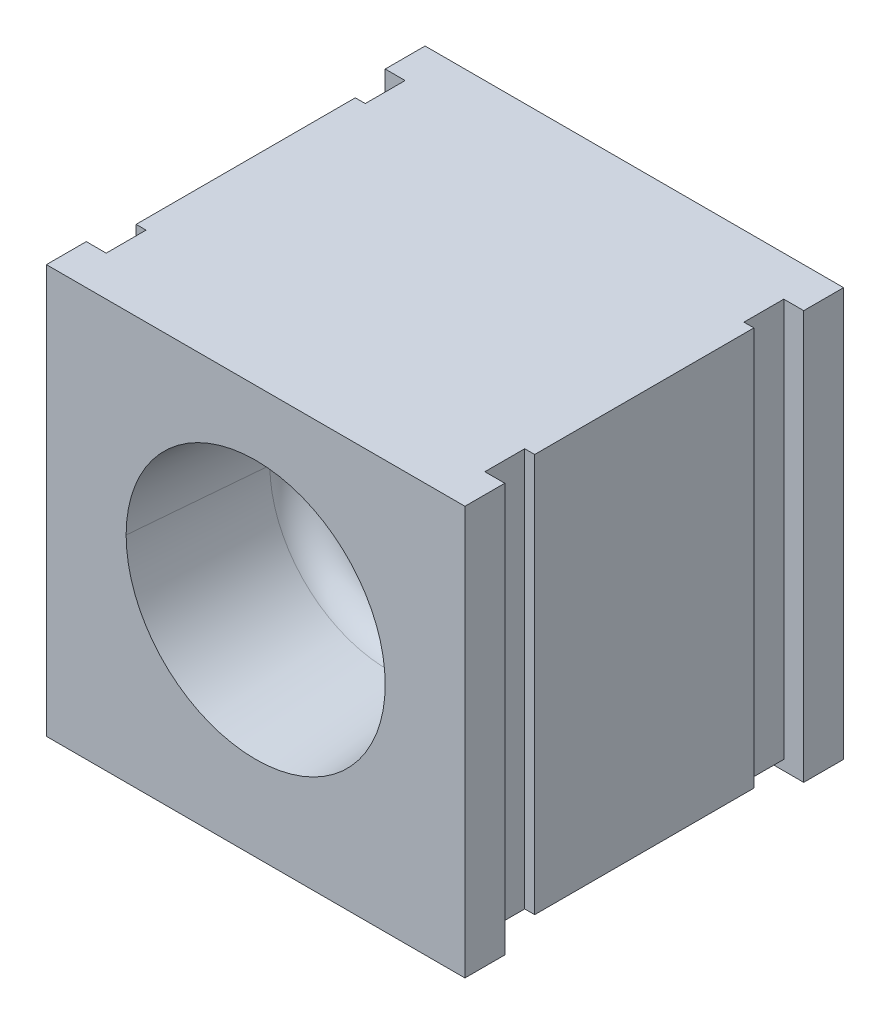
ISO-10303-21;
HEADER;
FILE_DESCRIPTION(('STEP AP214'),'2;1');
FILE_NAME('part.step','',(''),(''),'','','');
FILE_SCHEMA(('AUTOMOTIVE_DESIGN { 1 0 10303 214 1 1 1 1 }'));
ENDSEC;
DATA;
#1=APPLICATION_CONTEXT('core data for automotive mechanical design processes');
#2=APPLICATION_PROTOCOL_DEFINITION('international standard','automotive_design',2000,#1);
#3=PRODUCT_CONTEXT('',#1,'mechanical');
#4=PRODUCT('Part','Part','',(#3));
#5=PRODUCT_RELATED_PRODUCT_CATEGORY('part','',(#4));
#6=PRODUCT_DEFINITION_FORMATION('','',#4);
#7=PRODUCT_DEFINITION_CONTEXT('part definition',#1,'design');
#8=PRODUCT_DEFINITION('design','',#6,#7);
#9=PRODUCT_DEFINITION_SHAPE('','',#8);
#10=(LENGTH_UNIT() NAMED_UNIT(*) SI_UNIT(.MILLI.,.METRE.));
#11=(NAMED_UNIT(*) PLANE_ANGLE_UNIT() SI_UNIT($,.RADIAN.));
#12=(NAMED_UNIT(*) SI_UNIT($,.STERADIAN.) SOLID_ANGLE_UNIT());
#13=UNCERTAINTY_MEASURE_WITH_UNIT(LENGTH_MEASURE(1.E-05),#10,'distance_accuracy_value','');
#14=(GEOMETRIC_REPRESENTATION_CONTEXT(3) GLOBAL_UNCERTAINTY_ASSIGNED_CONTEXT((#13)) GLOBAL_UNIT_ASSIGNED_CONTEXT((#10,
#11,#12)) REPRESENTATION_CONTEXT('',''));
#15=CARTESIAN_POINT('',(0.,0.,0.));
#16=DIRECTION('',(0.,0.,1.));
#17=DIRECTION('',(1.,0.,0.));
#18=AXIS2_PLACEMENT_3D('',#15,#16,#17);
#19=CARTESIAN_POINT('',(10.5,-10.,40.0059515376));
#20=DIRECTION('',(0.,1.,0.));
#21=DIRECTION('',(1.,0.,0.));
#22=AXIS2_PLACEMENT_3D('',#19,#20,#21);
#23=PLANE('',#22);
#24=DIRECTION('',(0.,0.,-1.));
#25=VECTOR('',#24,1.);
#26=CARTESIAN_POINT('',(-10.5,-10.,40.0059515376));
#27=LINE('',#26,#25);
#28=CARTESIAN_POINT('',(-10.5,-10.,2.));
#29=VERTEX_POINT('',#28);
#30=CARTESIAN_POINT('',(-10.5,-10.,0.));
#31=VERTEX_POINT('',#30);
#32=EDGE_CURVE('E291',#29,#31,#27,.T.);
#33=ORIENTED_EDGE('',*,*,#32,.T.);
#34=DIRECTION('',(1.,0.,0.));
#35=VECTOR('',#34,1.);
#36=CARTESIAN_POINT('',(10.5,-10.,0.));
#37=LINE('',#36,#35);
#38=CARTESIAN_POINT('',(10.5,-10.,0.));
#39=VERTEX_POINT('',#38);
#40=EDGE_CURVE('E372',#31,#39,#37,.T.);
#41=ORIENTED_EDGE('',*,*,#40,.T.);
#42=DIRECTION('',(0.,0.,-1.));
#43=VECTOR('',#42,1.);
#44=CARTESIAN_POINT('',(10.5,-10.,40.0059515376));
#45=LINE('',#44,#43);
#46=CARTESIAN_POINT('',(10.5,-10.,2.));
#47=VERTEX_POINT('',#46);
#48=EDGE_CURVE('E299',#47,#39,#45,.T.);
#49=ORIENTED_EDGE('',*,*,#48,.F.);
#50=DIRECTION('',(1.,0.,0.));
#51=VECTOR('',#50,1.);
#52=CARTESIAN_POINT('',(-10.5,-10.,2.));
#53=LINE('',#52,#51);
#54=EDGE_CURVE('E253',#29,#47,#53,.T.);
#55=ORIENTED_EDGE('',*,*,#54,.F.);
#56=EDGE_LOOP('',(#33,#41,#49,#55));
#57=FACE_BOUND('',#56,.T.);
#58=ADVANCED_FACE('F15',(#57),#23,.F.);
#59=CARTESIAN_POINT('',(10.5,-10.,40.0059515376));
#60=DIRECTION('',(0.,1.,0.));
#61=DIRECTION('',(1.,0.,0.));
#62=AXIS2_PLACEMENT_3D('',#59,#60,#61);
#63=PLANE('',#62);
#64=DIRECTION('',(0.,0.,-1.));
#65=VECTOR('',#64,1.);
#66=CARTESIAN_POINT('',(10.5,-10.,40.0059515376));
#67=LINE('',#66,#65);
#68=CARTESIAN_POINT('',(10.5,-10.,19.));
#69=VERTEX_POINT('',#68);
#70=CARTESIAN_POINT('',(10.5,-10.,17.));
#71=VERTEX_POINT('',#70);
#72=EDGE_CURVE('E178',#69,#71,#67,.T.);
#73=ORIENTED_EDGE('',*,*,#72,.F.);
#74=DIRECTION('',(1.,0.,0.));
#75=VECTOR('',#74,1.);
#76=CARTESIAN_POINT('',(10.5,-10.,19.));
#77=LINE('',#76,#75);
#78=CARTESIAN_POINT('',(-10.5,-10.,19.));
#79=VERTEX_POINT('',#78);
#80=EDGE_CURVE('E37',#79,#69,#77,.T.);
#81=ORIENTED_EDGE('',*,*,#80,.F.);
#82=DIRECTION('',(0.,0.,-1.));
#83=VECTOR('',#82,1.);
#84=CARTESIAN_POINT('',(-10.5,-10.,40.0059515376));
#85=LINE('',#84,#83);
#86=CARTESIAN_POINT('',(-10.5,-10.,17.));
#87=VERTEX_POINT('',#86);
#88=EDGE_CURVE('E184',#79,#87,#85,.T.);
#89=ORIENTED_EDGE('',*,*,#88,.T.);
#90=DIRECTION('',(-1.,0.,0.));
#91=VECTOR('',#90,1.);
#92=CARTESIAN_POINT('',(-10.5,-10.,17.));
#93=LINE('',#92,#91);
#94=EDGE_CURVE('E188',#71,#87,#93,.T.);
#95=ORIENTED_EDGE('',*,*,#94,.F.);
#96=EDGE_LOOP('',(#73,#81,#89,#95));
#97=FACE_BOUND('',#96,.T.);
#98=ADVANCED_FACE('F186',(#97),#63,.F.);
#99=CARTESIAN_POINT('',(0.,0.75,12.5));
#100=DIRECTION('',(0.,0.,1.));
#101=DIRECTION('',(1.,0.,0.));
#102=AXIS2_PLACEMENT_3D('',#99,#100,#101);
#103=TOROIDAL_SURFACE('',#102,4.42559393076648,1.5);
#104=CARTESIAN_POINT('',(-4.42559393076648,0.75,12.5));
#105=DIRECTION('',(0.,1.,0.));
#106=DIRECTION('',(-1.,0.,0.));
#107=AXIS2_PLACEMENT_3D('',#104,#105,#106);
#108=CIRCLE('',#107,1.5);
#109=CARTESIAN_POINT('',(-4.42559393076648,0.75,11.));
#110=VERTEX_POINT('',#109);
#111=CARTESIAN_POINT('',(-5.91988597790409,0.75,12.3692663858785));
#112=VERTEX_POINT('',#111);
#113=EDGE_CURVE('E613',#110,#112,#108,.T.);
#114=ORIENTED_EDGE('',*,*,#113,.F.);
#115=CARTESIAN_POINT('',(0.,0.75,11.));
#116=DIRECTION('',(0.,0.,1.));
#117=DIRECTION('',(1.,0.,0.));
#118=AXIS2_PLACEMENT_3D('',#115,#116,#117);
#119=CIRCLE('',#118,4.42559393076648);
#120=CARTESIAN_POINT('',(4.42559393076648,0.75,11.));
#121=VERTEX_POINT('',#120);
#122=EDGE_CURVE('E9',#121,#110,#119,.T.);
#123=ORIENTED_EDGE('',*,*,#122,.F.);
#124=CARTESIAN_POINT('',(4.42559393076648,0.75,12.5));
#125=DIRECTION('',(0.,-1.,0.));
#126=DIRECTION('',(0.,0.,-1.));
#127=AXIS2_PLACEMENT_3D('',#124,#125,#126);
#128=CIRCLE('',#127,1.5);
#129=CARTESIAN_POINT('',(5.91988597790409,0.75,12.3692663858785));
#130=VERTEX_POINT('',#129);
#131=EDGE_CURVE('E532',#121,#130,#128,.T.);
#132=ORIENTED_EDGE('',*,*,#131,.T.);
#133=CARTESIAN_POINT('',(0.,0.75,12.3692663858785));
#134=DIRECTION('',(0.,0.,-1.));
#135=DIRECTION('',(-1.,0.,0.));
#136=AXIS2_PLACEMENT_3D('',#133,#134,#135);
#137=CIRCLE('',#136,5.91988597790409);
#138=EDGE_CURVE('E24',#112,#130,#137,.T.);
#139=ORIENTED_EDGE('',*,*,#138,.F.);
#140=EDGE_LOOP('',(#114,#123,#132,#139));
#141=FACE_BOUND('',#140,.T.);
#142=ADVANCED_FACE('F473',(#141),#103,.F.);
#143=CARTESIAN_POINT('',(0.,0.75,11.));
#144=DIRECTION('',(0.,0.,1.));
#145=DIRECTION('',(1.,0.,0.));
#146=AXIS2_PLACEMENT_3D('',#143,#144,#145);
#147=PLANE('',#146);
#148=ORIENTED_EDGE('',*,*,#122,.T.);
#149=CARTESIAN_POINT('',(0.,0.75,11.));
#150=DIRECTION('',(0.,0.,1.));
#151=DIRECTION('',(1.,0.,0.));
#152=AXIS2_PLACEMENT_3D('',#149,#150,#151);
#153=CIRCLE('',#152,4.42559393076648);
#154=EDGE_CURVE('E623',#110,#121,#153,.T.);
#155=ORIENTED_EDGE('',*,*,#154,.T.);
#156=EDGE_LOOP('',(#148,#155));
#157=FACE_BOUND('',#156,.T.);
#158=ADVANCED_FACE('F601',(#157),#147,.T.);
#159=CARTESIAN_POINT('',(0.,0.75,19.));
#160=DIRECTION('',(0.,0.,1.));
#161=DIRECTION('',(1.,0.,0.));
#162=AXIS2_PLACEMENT_3D('',#159,#160,#161);
#163=CONICAL_SURFACE('',#162,6.5,0.0872664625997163);
#164=DIRECTION('',(-0.0871557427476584,0.,0.996194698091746));
#165=VECTOR('',#164,1.);
#166=CARTESIAN_POINT('',(-6.5,0.75,19.));
#167=LINE('',#166,#165);
#168=CARTESIAN_POINT('',(-6.5,0.75,19.));
#169=VERTEX_POINT('',#168);
#170=EDGE_CURVE('E529',#112,#169,#167,.T.);
#171=ORIENTED_EDGE('',*,*,#170,.F.);
#172=ORIENTED_EDGE('',*,*,#138,.T.);
#173=DIRECTION('',(0.0871557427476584,0.,0.996194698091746));
#174=VECTOR('',#173,1.);
#175=CARTESIAN_POINT('',(6.5,0.75,19.));
#176=LINE('',#175,#174);
#177=CARTESIAN_POINT('',(6.5,0.75,19.));
#178=VERTEX_POINT('',#177);
#179=EDGE_CURVE('E441',#130,#178,#176,.T.);
#180=ORIENTED_EDGE('',*,*,#179,.T.);
#181=CARTESIAN_POINT('',(0.,0.75,19.));
#182=DIRECTION('',(0.,0.,1.));
#183=DIRECTION('',(1.,0.,0.));
#184=AXIS2_PLACEMENT_3D('',#181,#182,#183);
#185=CIRCLE('',#184,6.5);
#186=EDGE_CURVE('E221',#178,#169,#185,.T.);
#187=ORIENTED_EDGE('',*,*,#186,.T.);
#188=EDGE_LOOP('',(#171,#172,#180,#187));
#189=FACE_BOUND('',#188,.T.);
#190=ADVANCED_FACE('F594',(#189),#163,.F.);
#191=CARTESIAN_POINT('',(-10.5,-10.5,19.));
#192=DIRECTION('',(0.,0.,1.));
#193=DIRECTION('',(1.,0.,0.));
#194=AXIS2_PLACEMENT_3D('',#191,#192,#193);
#195=PLANE('',#194);
#196=ORIENTED_EDGE('',*,*,#186,.F.);
#197=CARTESIAN_POINT('',(0.,0.75,19.));
#198=DIRECTION('',(0.,0.,1.));
#199=DIRECTION('',(1.,0.,0.));
#200=AXIS2_PLACEMENT_3D('',#197,#198,#199);
#201=CIRCLE('',#200,6.5);
#202=EDGE_CURVE('E437',#169,#178,#201,.T.);
#203=ORIENTED_EDGE('',*,*,#202,.F.);
#204=EDGE_LOOP('',(#196,#203));
#205=FACE_BOUND('',#204,.T.);
#206=ORIENTED_EDGE('',*,*,#80,.T.);
#207=DIRECTION('',(0.,1.,0.));
#208=VECTOR('',#207,1.);
#209=CARTESIAN_POINT('',(10.5,10.5,19.));
#210=LINE('',#209,#208);
#211=CARTESIAN_POINT('',(10.5,10.5,19.));
#212=VERTEX_POINT('',#211);
#213=EDGE_CURVE('E217',#69,#212,#210,.T.);
#214=ORIENTED_EDGE('',*,*,#213,.T.);
#215=DIRECTION('',(-1.,0.,0.));
#216=VECTOR('',#215,1.);
#217=CARTESIAN_POINT('',(-10.5,10.5,19.));
#218=LINE('',#217,#216);
#219=CARTESIAN_POINT('',(-10.5,10.5,19.));
#220=VERTEX_POINT('',#219);
#221=EDGE_CURVE('E342',#212,#220,#218,.T.);
#222=ORIENTED_EDGE('',*,*,#221,.T.);
#223=DIRECTION('',(0.,-1.,0.));
#224=VECTOR('',#223,1.);
#225=CARTESIAN_POINT('',(-10.5,10.5,19.));
#226=LINE('',#225,#224);
#227=EDGE_CURVE('E192',#220,#79,#226,.T.);
#228=ORIENTED_EDGE('',*,*,#227,.T.);
#229=EDGE_LOOP('',(#206,#214,#222,#228));
#230=FACE_BOUND('',#229,.T.);
#231=ADVANCED_FACE('F585',(#205,#230),#195,.T.);
#232=CARTESIAN_POINT('',(10.5,10.5,19.));
#233=DIRECTION('',(-1.,0.,0.));
#234=DIRECTION('',(0.,1.,0.));
#235=AXIS2_PLACEMENT_3D('',#232,#233,#234);
#236=PLANE('',#235);
#237=ORIENTED_EDGE('',*,*,#213,.F.);
#238=ORIENTED_EDGE('',*,*,#72,.T.);
#239=DIRECTION('',(0.,1.,0.));
#240=VECTOR('',#239,1.);
#241=CARTESIAN_POINT('',(10.5,10.5,17.));
#242=LINE('',#241,#240);
#243=CARTESIAN_POINT('',(10.5,10.5,17.));
#244=VERTEX_POINT('',#243);
#245=EDGE_CURVE('E206',#71,#244,#242,.T.);
#246=ORIENTED_EDGE('',*,*,#245,.T.);
#247=DIRECTION('',(0.,0.,-1.));
#248=VECTOR('',#247,1.);
#249=CARTESIAN_POINT('',(10.5,10.5,19.));
#250=LINE('',#249,#248);
#251=EDGE_CURVE('E347',#212,#244,#250,.T.);
#252=ORIENTED_EDGE('',*,*,#251,.F.);
#253=EDGE_LOOP('',(#237,#238,#246,#252));
#254=FACE_BOUND('',#253,.T.);
#255=ADVANCED_FACE('F586',(#254),#236,.F.);
#256=CARTESIAN_POINT('',(-10.5,10.5,19.));
#257=DIRECTION('',(1.,0.,0.));
#258=DIRECTION('',(0.,1.,0.));
#259=AXIS2_PLACEMENT_3D('',#256,#257,#258);
#260=PLANE('',#259);
#261=DIRECTION('',(0.,-1.,0.));
#262=VECTOR('',#261,1.);
#263=CARTESIAN_POINT('',(-10.5,10.5,17.));
#264=LINE('',#263,#262);
#265=CARTESIAN_POINT('',(-10.5,10.5,17.));
#266=VERTEX_POINT('',#265);
#267=EDGE_CURVE('E193',#266,#87,#264,.T.);
#268=ORIENTED_EDGE('',*,*,#267,.T.);
#269=ORIENTED_EDGE('',*,*,#88,.F.);
#270=ORIENTED_EDGE('',*,*,#227,.F.);
#271=DIRECTION('',(0.,0.,-1.));
#272=VECTOR('',#271,1.);
#273=CARTESIAN_POINT('',(-10.5,10.5,19.));
#274=LINE('',#273,#272);
#275=EDGE_CURVE('E198',#220,#266,#274,.T.);
#276=ORIENTED_EDGE('',*,*,#275,.T.);
#277=EDGE_LOOP('',(#268,#269,#270,#276));
#278=FACE_BOUND('',#277,.T.);
#279=ADVANCED_FACE('F196',(#278),#260,.F.);
#280=CARTESIAN_POINT('',(-10.5,-10.5,17.));
#281=DIRECTION('',(0.,0.,1.));
#282=DIRECTION('',(1.,0.,0.));
#283=AXIS2_PLACEMENT_3D('',#280,#281,#282);
#284=PLANE('',#283);
#285=ORIENTED_EDGE('',*,*,#245,.F.);
#286=ORIENTED_EDGE('',*,*,#94,.T.);
#287=ORIENTED_EDGE('',*,*,#267,.F.);
#288=DIRECTION('',(-1.,0.,0.));
#289=VECTOR('',#288,1.);
#290=CARTESIAN_POINT('',(-10.5,10.5,17.));
#291=LINE('',#290,#289);
#292=CARTESIAN_POINT('',(-9.5,10.5,17.));
#293=VERTEX_POINT('',#292);
#294=EDGE_CURVE('E284',#293,#266,#291,.T.);
#295=ORIENTED_EDGE('',*,*,#294,.F.);
#296=DIRECTION('',(0.,-1.,0.));
#297=VECTOR('',#296,1.);
#298=CARTESIAN_POINT('',(-9.5,-9.5,17.));
#299=LINE('',#298,#297);
#300=CARTESIAN_POINT('',(-9.5,-9.5,17.));
#301=VERTEX_POINT('',#300);
#302=EDGE_CURVE('E212',#293,#301,#299,.T.);
#303=ORIENTED_EDGE('',*,*,#302,.T.);
#304=DIRECTION('',(1.,0.,0.));
#305=VECTOR('',#304,1.);
#306=CARTESIAN_POINT('',(9.5,-9.5,17.));
#307=LINE('',#306,#305);
#308=CARTESIAN_POINT('',(9.5,-9.5,17.));
#309=VERTEX_POINT('',#308);
#310=EDGE_CURVE('E254',#301,#309,#307,.T.);
#311=ORIENTED_EDGE('',*,*,#310,.T.);
#312=DIRECTION('',(0.,1.,0.));
#313=VECTOR('',#312,1.);
#314=CARTESIAN_POINT('',(9.5,-9.5,17.));
#315=LINE('',#314,#313);
#316=CARTESIAN_POINT('',(9.5,10.5,17.));
#317=VERTEX_POINT('',#316);
#318=EDGE_CURVE('E322',#309,#317,#315,.T.);
#319=ORIENTED_EDGE('',*,*,#318,.T.);
#320=DIRECTION('',(-1.,0.,0.));
#321=VECTOR('',#320,1.);
#322=CARTESIAN_POINT('',(-10.5,10.5,17.));
#323=LINE('',#322,#321);
#324=EDGE_CURVE('E353',#244,#317,#323,.T.);
#325=ORIENTED_EDGE('',*,*,#324,.F.);
#326=EDGE_LOOP('',(#285,#286,#287,#295,#303,#311,#319,#325));
#327=FACE_BOUND('',#326,.T.);
#328=ADVANCED_FACE('F204',(#327),#284,.F.);
#329=CARTESIAN_POINT('',(-9.5,-9.5,17.));
#330=DIRECTION('',(1.,0.,0.));
#331=DIRECTION('',(0.,1.,0.));
#332=AXIS2_PLACEMENT_3D('',#329,#330,#331);
#333=PLANE('',#332);
#334=DIRECTION('',(0.,-1.,0.));
#335=VECTOR('',#334,1.);
#336=CARTESIAN_POINT('',(-9.5,-9.5,15.));
#337=LINE('',#336,#335);
#338=CARTESIAN_POINT('',(-9.5,10.5,15.));
#339=VERTEX_POINT('',#338);
#340=CARTESIAN_POINT('',(-9.5,-9.5,15.));
#341=VERTEX_POINT('',#340);
#342=EDGE_CURVE('E319',#339,#341,#337,.T.);
#343=ORIENTED_EDGE('',*,*,#342,.T.);
#344=DIRECTION('',(0.,0.,-1.));
#345=VECTOR('',#344,1.);
#346=CARTESIAN_POINT('',(-9.5,-9.5,17.));
#347=LINE('',#346,#345);
#348=EDGE_CURVE('E258',#301,#341,#347,.T.);
#349=ORIENTED_EDGE('',*,*,#348,.F.);
#350=ORIENTED_EDGE('',*,*,#302,.F.);
#351=DIRECTION('',(0.,0.,-1.));
#352=VECTOR('',#351,1.);
#353=CARTESIAN_POINT('',(-9.5,10.5,17.));
#354=LINE('',#353,#352);
#355=EDGE_CURVE('E287',#293,#339,#354,.T.);
#356=ORIENTED_EDGE('',*,*,#355,.T.);
#357=EDGE_LOOP('',(#343,#349,#350,#356));
#358=FACE_BOUND('',#357,.T.);
#359=ADVANCED_FACE('F417',(#358),#333,.F.);
#360=CARTESIAN_POINT('',(9.5,-9.5,17.));
#361=DIRECTION('',(-1.,0.,0.));
#362=DIRECTION('',(0.,1.,0.));
#363=AXIS2_PLACEMENT_3D('',#360,#361,#362);
#364=PLANE('',#363);
#365=DIRECTION('',(0.,1.,0.));
#366=VECTOR('',#365,1.);
#367=CARTESIAN_POINT('',(9.5,-9.5,15.));
#368=LINE('',#367,#366);
#369=CARTESIAN_POINT('',(9.5,-9.5,15.));
#370=VERTEX_POINT('',#369);
#371=CARTESIAN_POINT('',(9.5,10.5,15.));
#372=VERTEX_POINT('',#371);
#373=EDGE_CURVE('E443',#370,#372,#368,.T.);
#374=ORIENTED_EDGE('',*,*,#373,.T.);
#375=DIRECTION('',(0.,0.,-1.));
#376=VECTOR('',#375,1.);
#377=CARTESIAN_POINT('',(9.5,10.5,17.));
#378=LINE('',#377,#376);
#379=EDGE_CURVE('E357',#317,#372,#378,.T.);
#380=ORIENTED_EDGE('',*,*,#379,.F.);
#381=ORIENTED_EDGE('',*,*,#318,.F.);
#382=DIRECTION('',(0.,0.,-1.));
#383=VECTOR('',#382,1.);
#384=CARTESIAN_POINT('',(9.5,-9.5,17.));
#385=LINE('',#384,#383);
#386=EDGE_CURVE('E259',#309,#370,#385,.T.);
#387=ORIENTED_EDGE('',*,*,#386,.T.);
#388=EDGE_LOOP('',(#374,#380,#381,#387));
#389=FACE_BOUND('',#388,.T.);
#390=ADVANCED_FACE('F455',(#389),#364,.F.);
#391=CARTESIAN_POINT('',(-10.,-9.5,15.));
#392=DIRECTION('',(0.,0.,1.));
#393=DIRECTION('',(1.,0.,0.));
#394=AXIS2_PLACEMENT_3D('',#391,#392,#393);
#395=PLANE('',#394);
#396=ORIENTED_EDGE('',*,*,#342,.F.);
#397=DIRECTION('',(-1.,0.,0.));
#398=VECTOR('',#397,1.);
#399=CARTESIAN_POINT('',(-10.,10.5,15.));
#400=LINE('',#399,#398);
#401=CARTESIAN_POINT('',(-10.,10.5,15.));
#402=VERTEX_POINT('',#401);
#403=EDGE_CURVE('E334',#339,#402,#400,.T.);
#404=ORIENTED_EDGE('',*,*,#403,.T.);
#405=DIRECTION('',(0.,-1.,0.));
#406=VECTOR('',#405,1.);
#407=CARTESIAN_POINT('',(-10.,10.5,15.));
#408=LINE('',#407,#406);
#409=CARTESIAN_POINT('',(-10.,-9.5,15.));
#410=VERTEX_POINT('',#409);
#411=EDGE_CURVE('E323',#402,#410,#408,.T.);
#412=ORIENTED_EDGE('',*,*,#411,.T.);
#413=DIRECTION('',(1.,0.,0.));
#414=VECTOR('',#413,1.);
#415=CARTESIAN_POINT('',(-10.,-9.5,15.));
#416=LINE('',#415,#414);
#417=EDGE_CURVE('E394',#410,#341,#416,.T.);
#418=ORIENTED_EDGE('',*,*,#417,.T.);
#419=EDGE_LOOP('',(#396,#404,#412,#418));
#420=FACE_BOUND('',#419,.T.);
#421=ADVANCED_FACE('F457',(#420),#395,.T.);
#422=CARTESIAN_POINT('',(10.,10.5,6.));
#423=DIRECTION('',(-1.,0.,0.));
#424=DIRECTION('',(0.,1.,0.));
#425=AXIS2_PLACEMENT_3D('',#422,#423,#424);
#426=PLANE('',#425);
#427=DIRECTION('',(0.,1.,0.));
#428=VECTOR('',#427,1.);
#429=CARTESIAN_POINT('',(10.,10.5,4.));
#430=LINE('',#429,#428);
#431=CARTESIAN_POINT('',(10.,-9.5,4.));
#432=VERTEX_POINT('',#431);
#433=CARTESIAN_POINT('',(10.,10.5,4.));
#434=VERTEX_POINT('',#433);
#435=EDGE_CURVE('E303',#432,#434,#430,.T.);
#436=ORIENTED_EDGE('',*,*,#435,.T.);
#437=DIRECTION('',(0.,0.,-1.));
#438=VECTOR('',#437,1.);
#439=CARTESIAN_POINT('',(10.,10.5,6.));
#440=LINE('',#439,#438);
#441=CARTESIAN_POINT('',(10.,10.5,15.));
#442=VERTEX_POINT('',#441);
#443=EDGE_CURVE('E361',#442,#434,#440,.T.);
#444=ORIENTED_EDGE('',*,*,#443,.F.);
#445=DIRECTION('',(0.,1.,0.));
#446=VECTOR('',#445,1.);
#447=CARTESIAN_POINT('',(10.,10.5,15.));
#448=LINE('',#447,#446);
#449=CARTESIAN_POINT('',(10.,-9.5,15.));
#450=VERTEX_POINT('',#449);
#451=EDGE_CURVE('E242',#450,#442,#448,.T.);
#452=ORIENTED_EDGE('',*,*,#451,.F.);
#453=DIRECTION('',(0.,0.,-1.));
#454=VECTOR('',#453,1.);
#455=CARTESIAN_POINT('',(10.,-9.5,6.));
#456=LINE('',#455,#454);
#457=EDGE_CURVE('E390',#450,#432,#456,.T.);
#458=ORIENTED_EDGE('',*,*,#457,.T.);
#459=EDGE_LOOP('',(#436,#444,#452,#458));
#460=FACE_BOUND('',#459,.T.);
#461=ADVANCED_FACE('F464',(#460),#426,.F.);
#462=CARTESIAN_POINT('',(-10.,10.5,6.));
#463=DIRECTION('',(1.,0.,0.));
#464=DIRECTION('',(0.,1.,0.));
#465=AXIS2_PLACEMENT_3D('',#462,#463,#464);
#466=PLANE('',#465);
#467=DIRECTION('',(0.,-1.,0.));
#468=VECTOR('',#467,1.);
#469=CARTESIAN_POINT('',(-10.,10.5,4.));
#470=LINE('',#469,#468);
#471=CARTESIAN_POINT('',(-10.,10.5,4.));
#472=VERTEX_POINT('',#471);
#473=CARTESIAN_POINT('',(-10.,-9.5,4.));
#474=VERTEX_POINT('',#473);
#475=EDGE_CURVE('E300',#472,#474,#470,.T.);
#476=ORIENTED_EDGE('',*,*,#475,.T.);
#477=DIRECTION('',(0.,0.,-1.));
#478=VECTOR('',#477,1.);
#479=CARTESIAN_POINT('',(-10.,-9.5,6.));
#480=LINE('',#479,#478);
#481=EDGE_CURVE('E279',#410,#474,#480,.T.);
#482=ORIENTED_EDGE('',*,*,#481,.F.);
#483=ORIENTED_EDGE('',*,*,#411,.F.);
#484=DIRECTION('',(0.,0.,-1.));
#485=VECTOR('',#484,1.);
#486=CARTESIAN_POINT('',(-10.,10.5,6.));
#487=LINE('',#486,#485);
#488=EDGE_CURVE('E330',#402,#472,#487,.T.);
#489=ORIENTED_EDGE('',*,*,#488,.T.);
#490=EDGE_LOOP('',(#476,#482,#483,#489));
#491=FACE_BOUND('',#490,.T.);
#492=ADVANCED_FACE('F542',(#491),#466,.F.);
#493=CARTESIAN_POINT('',(-10.,-9.5,4.));
#494=DIRECTION('',(0.,0.,1.));
#495=DIRECTION('',(1.,0.,0.));
#496=AXIS2_PLACEMENT_3D('',#493,#494,#495);
#497=PLANE('',#496);
#498=DIRECTION('',(1.,0.,0.));
#499=VECTOR('',#498,1.);
#500=CARTESIAN_POINT('',(-10.,-9.5,4.));
#501=LINE('',#500,#499);
#502=CARTESIAN_POINT('',(9.5,-9.5,4.));
#503=VERTEX_POINT('',#502);
#504=EDGE_CURVE('E386',#503,#432,#501,.T.);
#505=ORIENTED_EDGE('',*,*,#504,.F.);
#506=DIRECTION('',(0.,1.,0.));
#507=VECTOR('',#506,1.);
#508=CARTESIAN_POINT('',(9.5,10.5,4.));
#509=LINE('',#508,#507);
#510=CARTESIAN_POINT('',(9.5,10.5,4.));
#511=VERTEX_POINT('',#510);
#512=EDGE_CURVE('E278',#503,#511,#509,.T.);
#513=ORIENTED_EDGE('',*,*,#512,.T.);
#514=DIRECTION('',(-1.,0.,0.));
#515=VECTOR('',#514,1.);
#516=CARTESIAN_POINT('',(-10.,10.5,4.));
#517=LINE('',#516,#515);
#518=EDGE_CURVE('E365',#434,#511,#517,.T.);
#519=ORIENTED_EDGE('',*,*,#518,.F.);
#520=ORIENTED_EDGE('',*,*,#435,.F.);
#521=EDGE_LOOP('',(#505,#513,#519,#520));
#522=FACE_BOUND('',#521,.T.);
#523=ADVANCED_FACE('F539',(#522),#497,.F.);
#524=CARTESIAN_POINT('',(-10.,-9.5,4.));
#525=DIRECTION('',(0.,0.,1.));
#526=DIRECTION('',(1.,0.,0.));
#527=AXIS2_PLACEMENT_3D('',#524,#525,#526);
#528=PLANE('',#527);
#529=DIRECTION('',(-1.,0.,0.));
#530=VECTOR('',#529,1.);
#531=CARTESIAN_POINT('',(-10.,10.5,4.));
#532=LINE('',#531,#530);
#533=CARTESIAN_POINT('',(-9.5,10.5,4.));
#534=VERTEX_POINT('',#533);
#535=EDGE_CURVE('E326',#534,#472,#532,.T.);
#536=ORIENTED_EDGE('',*,*,#535,.F.);
#537=DIRECTION('',(0.,-1.,0.));
#538=VECTOR('',#537,1.);
#539=CARTESIAN_POINT('',(-9.5,10.5,4.));
#540=LINE('',#539,#538);
#541=CARTESIAN_POINT('',(-9.5,-9.5,4.));
#542=VERTEX_POINT('',#541);
#543=EDGE_CURVE('E378',#534,#542,#540,.T.);
#544=ORIENTED_EDGE('',*,*,#543,.T.);
#545=DIRECTION('',(1.,0.,0.));
#546=VECTOR('',#545,1.);
#547=CARTESIAN_POINT('',(-10.,-9.5,4.));
#548=LINE('',#547,#546);
#549=EDGE_CURVE('E275',#474,#542,#548,.T.);
#550=ORIENTED_EDGE('',*,*,#549,.F.);
#551=ORIENTED_EDGE('',*,*,#475,.F.);
#552=EDGE_LOOP('',(#536,#544,#550,#551));
#553=FACE_BOUND('',#552,.T.);
#554=ADVANCED_FACE('F564',(#553),#528,.F.);
#555=CARTESIAN_POINT('',(9.5,10.5,4.));
#556=DIRECTION('',(-1.,0.,0.));
#557=DIRECTION('',(0.,1.,0.));
#558=AXIS2_PLACEMENT_3D('',#555,#556,#557);
#559=PLANE('',#558);
#560=DIRECTION('',(0.,1.,0.));
#561=VECTOR('',#560,1.);
#562=CARTESIAN_POINT('',(9.5,10.5,2.));
#563=LINE('',#562,#561);
#564=CARTESIAN_POINT('',(9.5,-9.5,2.));
#565=VERTEX_POINT('',#564);
#566=CARTESIAN_POINT('',(9.5,10.5,2.));
#567=VERTEX_POINT('',#566);
#568=EDGE_CURVE('E264',#565,#567,#563,.T.);
#569=ORIENTED_EDGE('',*,*,#568,.T.);
#570=DIRECTION('',(0.,0.,-1.));
#571=VECTOR('',#570,1.);
#572=CARTESIAN_POINT('',(9.5,10.5,4.));
#573=LINE('',#572,#571);
#574=EDGE_CURVE('E369',#511,#567,#573,.T.);
#575=ORIENTED_EDGE('',*,*,#574,.F.);
#576=ORIENTED_EDGE('',*,*,#512,.F.);
#577=DIRECTION('',(0.,0.,-1.));
#578=VECTOR('',#577,1.);
#579=CARTESIAN_POINT('',(9.5,-9.5,4.));
#580=LINE('',#579,#578);
#581=EDGE_CURVE('E382',#503,#565,#580,.T.);
#582=ORIENTED_EDGE('',*,*,#581,.T.);
#583=EDGE_LOOP('',(#569,#575,#576,#582));
#584=FACE_BOUND('',#583,.T.);
#585=ADVANCED_FACE('F512',(#584),#559,.F.);
#586=CARTESIAN_POINT('',(-9.5,-9.5,4.));
#587=DIRECTION('',(0.,1.,0.));
#588=DIRECTION('',(1.,0.,0.));
#589=AXIS2_PLACEMENT_3D('',#586,#587,#588);
#590=PLANE('',#589);
#591=DIRECTION('',(1.,0.,0.));
#592=VECTOR('',#591,1.);
#593=CARTESIAN_POINT('',(-9.5,-9.5,2.));
#594=LINE('',#593,#592);
#595=CARTESIAN_POINT('',(-9.5,-9.5,2.));
#596=VERTEX_POINT('',#595);
#597=EDGE_CURVE('E266',#596,#565,#594,.T.);
#598=ORIENTED_EDGE('',*,*,#597,.T.);
#599=ORIENTED_EDGE('',*,*,#581,.F.);
#600=ORIENTED_EDGE('',*,*,#504,.T.);
#601=ORIENTED_EDGE('',*,*,#457,.F.);
#602=DIRECTION('',(1.,0.,0.));
#603=VECTOR('',#602,1.);
#604=CARTESIAN_POINT('',(-10.,-9.5,15.));
#605=LINE('',#604,#603);
#606=EDGE_CURVE('E240',#370,#450,#605,.T.);
#607=ORIENTED_EDGE('',*,*,#606,.F.);
#608=ORIENTED_EDGE('',*,*,#386,.F.);
#609=ORIENTED_EDGE('',*,*,#310,.F.);
#610=ORIENTED_EDGE('',*,*,#348,.T.);
#611=ORIENTED_EDGE('',*,*,#417,.F.);
#612=ORIENTED_EDGE('',*,*,#481,.T.);
#613=ORIENTED_EDGE('',*,*,#549,.T.);
#614=DIRECTION('',(0.,0.,-1.));
#615=VECTOR('',#614,1.);
#616=CARTESIAN_POINT('',(-9.5,-9.5,4.));
#617=LINE('',#616,#615);
#618=EDGE_CURVE('E375',#542,#596,#617,.T.);
#619=ORIENTED_EDGE('',*,*,#618,.T.);
#620=EDGE_LOOP('',(#598,#599,#600,#601,#607,#608,#609,#610,#611,#612,#613,#619));
#621=FACE_BOUND('',#620,.T.);
#622=ADVANCED_FACE('F422',(#621),#590,.F.);
#623=CARTESIAN_POINT('',(-9.5,10.5,4.));
#624=DIRECTION('',(1.,0.,0.));
#625=DIRECTION('',(0.,1.,0.));
#626=AXIS2_PLACEMENT_3D('',#623,#624,#625);
#627=PLANE('',#626);
#628=DIRECTION('',(0.,-1.,0.));
#629=VECTOR('',#628,1.);
#630=CARTESIAN_POINT('',(-9.5,10.5,2.));
#631=LINE('',#630,#629);
#632=CARTESIAN_POINT('',(-9.5,10.5,2.));
#633=VERTEX_POINT('',#632);
#634=EDGE_CURVE('E270',#633,#596,#631,.T.);
#635=ORIENTED_EDGE('',*,*,#634,.T.);
#636=ORIENTED_EDGE('',*,*,#618,.F.);
#637=ORIENTED_EDGE('',*,*,#543,.F.);
#638=DIRECTION('',(0.,0.,-1.));
#639=VECTOR('',#638,1.);
#640=CARTESIAN_POINT('',(-9.5,10.5,4.));
#641=LINE('',#640,#639);
#642=EDGE_CURVE('E318',#534,#633,#641,.T.);
#643=ORIENTED_EDGE('',*,*,#642,.T.);
#644=EDGE_LOOP('',(#635,#636,#637,#643));
#645=FACE_BOUND('',#644,.T.);
#646=ADVANCED_FACE('F557',(#645),#627,.F.);
#647=CARTESIAN_POINT('',(-10.5,10.5,0.));
#648=DIRECTION('',(0.,0.,-1.));
#649=DIRECTION('',(0.,-1.,0.));
#650=AXIS2_PLACEMENT_3D('',#647,#648,#649);
#651=PLANE('',#650);
#652=ORIENTED_EDGE('',*,*,#40,.F.);
#653=DIRECTION('',(0.,-1.,0.));
#654=VECTOR('',#653,1.);
#655=CARTESIAN_POINT('',(-10.5,-10.5,0.));
#656=LINE('',#655,#654);
#657=CARTESIAN_POINT('',(-10.5,10.5,0.));
#658=VERTEX_POINT('',#657);
#659=EDGE_CURVE('E283',#658,#31,#656,.T.);
#660=ORIENTED_EDGE('',*,*,#659,.F.);
#661=DIRECTION('',(-1.,0.,0.));
#662=VECTOR('',#661,1.);
#663=CARTESIAN_POINT('',(-10.5,10.5,0.));
#664=LINE('',#663,#662);
#665=CARTESIAN_POINT('',(10.5,10.5,0.));
#666=VERTEX_POINT('',#665);
#667=EDGE_CURVE('E315',#666,#658,#664,.T.);
#668=ORIENTED_EDGE('',*,*,#667,.F.);
#669=DIRECTION('',(0.,1.,0.));
#670=VECTOR('',#669,1.);
#671=CARTESIAN_POINT('',(10.5,-10.5,0.));
#672=LINE('',#671,#670);
#673=EDGE_CURVE('E307',#39,#666,#672,.T.);
#674=ORIENTED_EDGE('',*,*,#673,.F.);
#675=EDGE_LOOP('',(#652,#660,#668,#674));
#676=FACE_BOUND('',#675,.T.);
#677=ADVANCED_FACE('F486',(#676),#651,.T.);
#678=CARTESIAN_POINT('',(-10.5,10.5,2.));
#679=DIRECTION('',(0.,-1.,0.));
#680=DIRECTION('',(0.,0.,-1.));
#681=AXIS2_PLACEMENT_3D('',#678,#679,#680);
#682=PLANE('',#681);
#683=ORIENTED_EDGE('',*,*,#667,.T.);
#684=DIRECTION('',(0.,0.,-1.));
#685=VECTOR('',#684,1.);
#686=CARTESIAN_POINT('',(-10.5,10.5,2.));
#687=LINE('',#686,#685);
#688=CARTESIAN_POINT('',(-10.5,10.5,2.));
#689=VERTEX_POINT('',#688);
#690=EDGE_CURVE('E295',#689,#658,#687,.T.);
#691=ORIENTED_EDGE('',*,*,#690,.F.);
#692=DIRECTION('',(-1.,0.,0.));
#693=VECTOR('',#692,1.);
#694=CARTESIAN_POINT('',(-10.5,10.5,2.));
#695=LINE('',#694,#693);
#696=EDGE_CURVE('E274',#633,#689,#695,.T.);
#697=ORIENTED_EDGE('',*,*,#696,.F.);
#698=ORIENTED_EDGE('',*,*,#642,.F.);
#699=ORIENTED_EDGE('',*,*,#535,.T.);
#700=ORIENTED_EDGE('',*,*,#488,.F.);
#701=ORIENTED_EDGE('',*,*,#403,.F.);
#702=ORIENTED_EDGE('',*,*,#355,.F.);
#703=ORIENTED_EDGE('',*,*,#294,.T.);
#704=ORIENTED_EDGE('',*,*,#275,.F.);
#705=ORIENTED_EDGE('',*,*,#221,.F.);
#706=ORIENTED_EDGE('',*,*,#251,.T.);
#707=ORIENTED_EDGE('',*,*,#324,.T.);
#708=ORIENTED_EDGE('',*,*,#379,.T.);
#709=DIRECTION('',(-1.,0.,0.));
#710=VECTOR('',#709,1.);
#711=CARTESIAN_POINT('',(-10.,10.5,15.));
#712=LINE('',#711,#710);
#713=EDGE_CURVE('E245',#442,#372,#712,.T.);
#714=ORIENTED_EDGE('',*,*,#713,.F.);
#715=ORIENTED_EDGE('',*,*,#443,.T.);
#716=ORIENTED_EDGE('',*,*,#518,.T.);
#717=ORIENTED_EDGE('',*,*,#574,.T.);
#718=DIRECTION('',(-1.,0.,0.));
#719=VECTOR('',#718,1.);
#720=CARTESIAN_POINT('',(-10.5,10.5,2.));
#721=LINE('',#720,#719);
#722=CARTESIAN_POINT('',(10.5,10.5,2.));
#723=VERTEX_POINT('',#722);
#724=EDGE_CURVE('E260',#723,#567,#721,.T.);
#725=ORIENTED_EDGE('',*,*,#724,.F.);
#726=DIRECTION('',(0.,0.,-1.));
#727=VECTOR('',#726,1.);
#728=CARTESIAN_POINT('',(10.5,10.5,2.));
#729=LINE('',#728,#727);
#730=EDGE_CURVE('E311',#723,#666,#729,.T.);
#731=ORIENTED_EDGE('',*,*,#730,.T.);
#732=EDGE_LOOP('',(#683,#691,#697,#698,#699,#700,#701,#702,#703,#704,#705,#706,#707,#708,#714,
#715,#716,#717,#725,#731));
#733=FACE_BOUND('',#732,.T.);
#734=ADVANCED_FACE('F454',(#733),#682,.F.);
#735=CARTESIAN_POINT('',(10.5,-10.5,2.));
#736=DIRECTION('',(-1.,0.,0.));
#737=DIRECTION('',(0.,0.,1.));
#738=AXIS2_PLACEMENT_3D('',#735,#736,#737);
#739=PLANE('',#738);
#740=DIRECTION('',(0.,1.,0.));
#741=VECTOR('',#740,1.);
#742=CARTESIAN_POINT('',(10.5,-10.5,2.));
#743=LINE('',#742,#741);
#744=EDGE_CURVE('E265',#47,#723,#743,.T.);
#745=ORIENTED_EDGE('',*,*,#744,.F.);
#746=ORIENTED_EDGE('',*,*,#48,.T.);
#747=ORIENTED_EDGE('',*,*,#673,.T.);
#748=ORIENTED_EDGE('',*,*,#730,.F.);
#749=EDGE_LOOP('',(#745,#746,#747,#748));
#750=FACE_BOUND('',#749,.T.);
#751=ADVANCED_FACE('F489',(#750),#739,.F.);
#752=CARTESIAN_POINT('',(-10.5,-10.5,2.));
#753=DIRECTION('',(1.,0.,0.));
#754=DIRECTION('',(0.,1.,0.));
#755=AXIS2_PLACEMENT_3D('',#752,#753,#754);
#756=PLANE('',#755);
#757=ORIENTED_EDGE('',*,*,#659,.T.);
#758=ORIENTED_EDGE('',*,*,#32,.F.);
#759=DIRECTION('',(0.,-1.,0.));
#760=VECTOR('',#759,1.);
#761=CARTESIAN_POINT('',(-10.5,-10.5,2.));
#762=LINE('',#761,#760);
#763=EDGE_CURVE('E249',#689,#29,#762,.T.);
#764=ORIENTED_EDGE('',*,*,#763,.F.);
#765=ORIENTED_EDGE('',*,*,#690,.T.);
#766=EDGE_LOOP('',(#757,#758,#764,#765));
#767=FACE_BOUND('',#766,.T.);
#768=ADVANCED_FACE('F483',(#767),#756,.F.);
#769=CARTESIAN_POINT('',(-10.5,10.5,2.));
#770=DIRECTION('',(0.,0.,-1.));
#771=DIRECTION('',(0.,-1.,0.));
#772=AXIS2_PLACEMENT_3D('',#769,#770,#771);
#773=PLANE('',#772);
#774=ORIENTED_EDGE('',*,*,#763,.T.);
#775=ORIENTED_EDGE('',*,*,#54,.T.);
#776=ORIENTED_EDGE('',*,*,#744,.T.);
#777=ORIENTED_EDGE('',*,*,#724,.T.);
#778=ORIENTED_EDGE('',*,*,#568,.F.);
#779=ORIENTED_EDGE('',*,*,#597,.F.);
#780=ORIENTED_EDGE('',*,*,#634,.F.);
#781=ORIENTED_EDGE('',*,*,#696,.T.);
#782=EDGE_LOOP('',(#774,#775,#776,#777,#778,#779,#780,#781));
#783=FACE_BOUND('',#782,.T.);
#784=ADVANCED_FACE('F520',(#783),#773,.F.);
#785=CARTESIAN_POINT('',(-10.,-9.5,15.));
#786=DIRECTION('',(0.,0.,1.));
#787=DIRECTION('',(1.,0.,0.));
#788=AXIS2_PLACEMENT_3D('',#785,#786,#787);
#789=PLANE('',#788);
#790=ORIENTED_EDGE('',*,*,#373,.F.);
#791=ORIENTED_EDGE('',*,*,#606,.T.);
#792=ORIENTED_EDGE('',*,*,#451,.T.);
#793=ORIENTED_EDGE('',*,*,#713,.T.);
#794=EDGE_LOOP('',(#790,#791,#792,#793));
#795=FACE_BOUND('',#794,.T.);
#796=ADVANCED_FACE('F448',(#795),#789,.T.);
#797=CARTESIAN_POINT('',(0.,0.75,19.));
#798=DIRECTION('',(0.,0.,1.));
#799=DIRECTION('',(1.,0.,0.));
#800=AXIS2_PLACEMENT_3D('',#797,#798,#799);
#801=CONICAL_SURFACE('',#800,6.5,0.0872664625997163);
#802=CARTESIAN_POINT('',(0.,0.75,12.3692663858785));
#803=DIRECTION('',(0.,0.,-1.));
#804=DIRECTION('',(-1.,0.,0.));
#805=AXIS2_PLACEMENT_3D('',#802,#803,#804);
#806=CIRCLE('',#805,5.91988597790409);
#807=EDGE_CURVE('E622',#130,#112,#806,.T.);
#808=ORIENTED_EDGE('',*,*,#807,.T.);
#809=ORIENTED_EDGE('',*,*,#170,.T.);
#810=ORIENTED_EDGE('',*,*,#202,.T.);
#811=ORIENTED_EDGE('',*,*,#179,.F.);
#812=EDGE_LOOP('',(#808,#809,#810,#811));
#813=FACE_BOUND('',#812,.T.);
#814=ADVANCED_FACE('F551',(#813),#801,.F.);
#815=CARTESIAN_POINT('',(0.,0.75,12.5));
#816=DIRECTION('',(0.,0.,1.));
#817=DIRECTION('',(1.,0.,0.));
#818=AXIS2_PLACEMENT_3D('',#815,#816,#817);
#819=TOROIDAL_SURFACE('',#818,4.42559393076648,1.5);
#820=ORIENTED_EDGE('',*,*,#154,.F.);
#821=ORIENTED_EDGE('',*,*,#113,.T.);
#822=ORIENTED_EDGE('',*,*,#807,.F.);
#823=ORIENTED_EDGE('',*,*,#131,.F.);
#824=EDGE_LOOP('',(#820,#821,#822,#823));
#825=FACE_BOUND('',#824,.T.);
#826=ADVANCED_FACE('F626',(#825),#819,.F.);
#827=CLOSED_SHELL('',(#58,#98,#142,#158,#190,#231,#255,#279,#328,#359,#390,#421,#461,#492,#523,
#554,#585,#622,#646,#677,#734,#751,#768,#784,#796,#814,#826));
#828=MANIFOLD_SOLID_BREP('B1',#827);
#829=ADVANCED_BREP_SHAPE_REPRESENTATION('',(#18,#828),#14);
#830=SHAPE_DEFINITION_REPRESENTATION(#9,#829);
ENDSEC;
END-ISO-10303-21;
